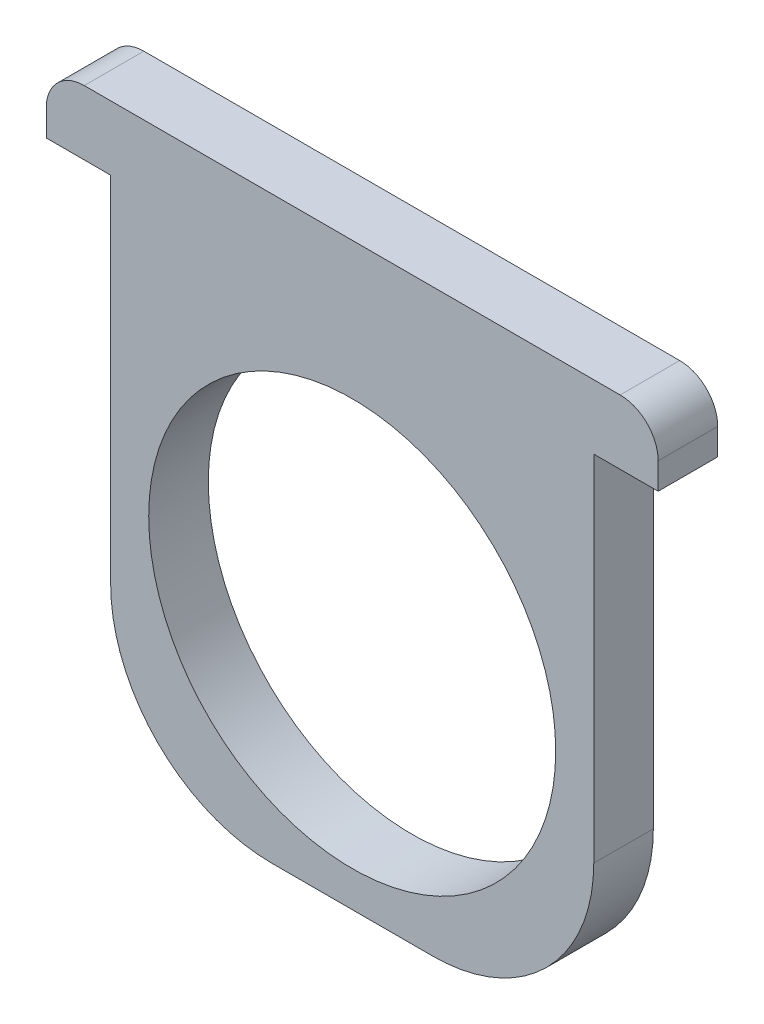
from build123d import *

# Parameters (mm, degrees)
BOSS_EXTRUDE1_DEPTH = 2.3495
SKETCH3_R           = 16.05
CUT_EXTRUDE1_DEPTH  = 36.348231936
FILLET1_R           = 12.7
FILLET2_R           = 3


with BuildPart() as part:
    # Sketch2 → Boss-Extrude1 (new, symmetric)
    with BuildSketch(Plane.XY):
        Polygon((19.05, 20.32), (24.13, 20.32), (24.13, 25.4), (-24.13, 25.4), (-24.13, 20.32), (-19.05, 20.32), (-19.05, -20.32), (19.05, -20.32), align=None)
    extrude(amount=BOSS_EXTRUDE1_DEPTH, both=True)

    # Sketch3 → Cut-Extrude1 (cut, through all)
    with BuildSketch(Plane(origin=(0, 0, -2.3495), x_dir=(-1, 0, 0), z_dir=(0, 0, -1))):
        with Locations((0, -1.468)):
            Circle(SKETCH3_R)
    extrude(amount=-CUT_EXTRUDE1_DEPTH, mode=Mode.SUBTRACT)

    # Fillet1
    fillet1_edges = [part.edges().sort_by_distance(p)[0] for p in [
        (19.05, -20.32, 0),
        (-19.05, -20.32, 0),
    ]]
    fillet(fillet1_edges, radius=FILLET1_R)

    # Fillet2
    fillet2_edges = [part.edges().sort_by_distance(p)[0] for p in [
        (-24.13, 25.4, 0),
        (24.13, 25.4, 0),
    ]]
    fillet(fillet2_edges, radius=FILLET2_R)


solid = part.part
